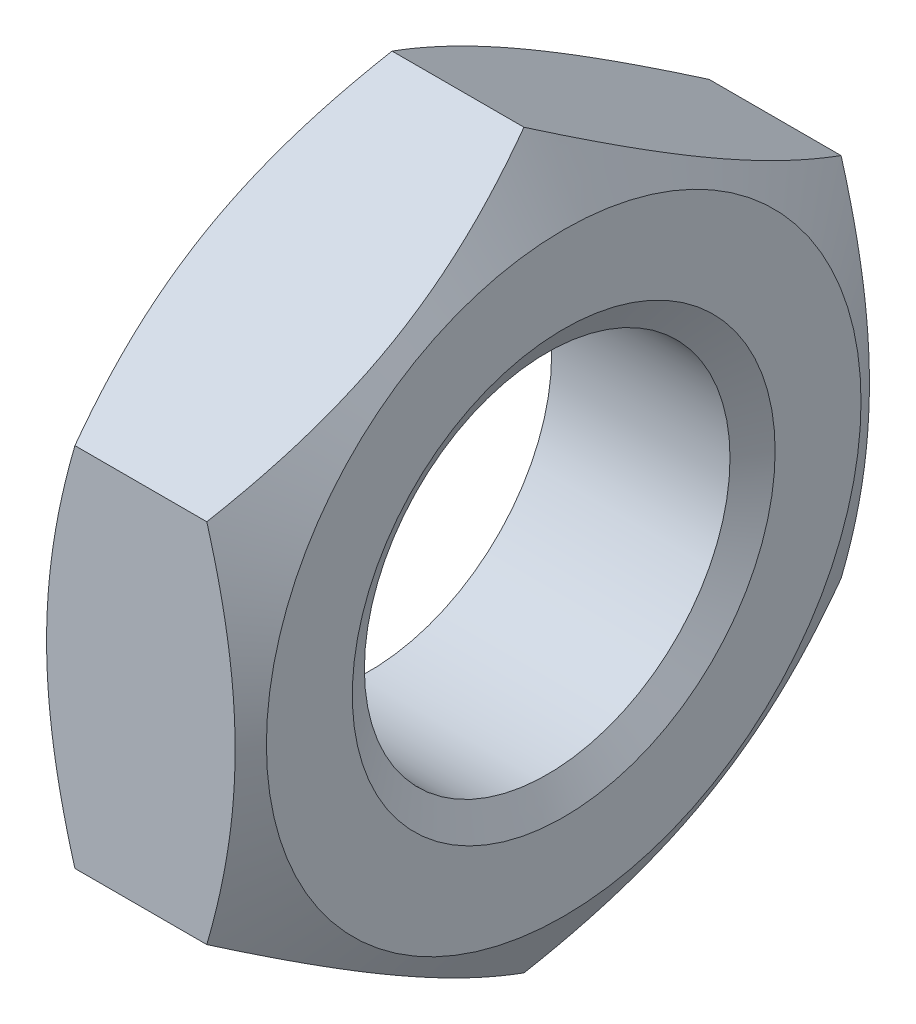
ISO-10303-21;
HEADER;
FILE_DESCRIPTION(('STEP AP214'),'2;1');
FILE_NAME('part.step','',(''),(''),'','','');
FILE_SCHEMA(('AUTOMOTIVE_DESIGN { 1 0 10303 214 1 1 1 1 }'));
ENDSEC;
DATA;
#1=APPLICATION_CONTEXT('core data for automotive mechanical design processes');
#2=APPLICATION_PROTOCOL_DEFINITION('international standard','automotive_design',2000,#1);
#3=PRODUCT_CONTEXT('',#1,'mechanical');
#4=PRODUCT('Part','Part','',(#3));
#5=PRODUCT_RELATED_PRODUCT_CATEGORY('part','',(#4));
#6=PRODUCT_DEFINITION_FORMATION('','',#4);
#7=PRODUCT_DEFINITION_CONTEXT('part definition',#1,'design');
#8=PRODUCT_DEFINITION('design','',#6,#7);
#9=PRODUCT_DEFINITION_SHAPE('','',#8);
#10=(LENGTH_UNIT() NAMED_UNIT(*) SI_UNIT(.MILLI.,.METRE.));
#11=(NAMED_UNIT(*) PLANE_ANGLE_UNIT() SI_UNIT($,.RADIAN.));
#12=(NAMED_UNIT(*) SI_UNIT($,.STERADIAN.) SOLID_ANGLE_UNIT());
#13=UNCERTAINTY_MEASURE_WITH_UNIT(LENGTH_MEASURE(1.E-05),#10,'distance_accuracy_value','');
#14=(GEOMETRIC_REPRESENTATION_CONTEXT(3) GLOBAL_UNCERTAINTY_ASSIGNED_CONTEXT((#13)) GLOBAL_UNIT_ASSIGNED_CONTEXT((#10,
#11,#12)) REPRESENTATION_CONTEXT('',''));
#15=CARTESIAN_POINT('',(0.,0.,0.));
#16=DIRECTION('',(0.,0.,1.));
#17=DIRECTION('',(1.,0.,0.));
#18=AXIS2_PLACEMENT_3D('',#15,#16,#17);
#19=CARTESIAN_POINT('',(8.,0.,0.));
#20=DIRECTION('',(1.,0.,0.));
#21=DIRECTION('',(0.,0.,-1.));
#22=AXIS2_PLACEMENT_3D('',#19,#20,#21);
#23=PLANE('',#22);
#24=CARTESIAN_POINT('',(8.,0.,0.));
#25=DIRECTION('',(1.,0.,0.));
#26=DIRECTION('',(0.,0.,-1.));
#27=AXIS2_PLACEMENT_3D('',#24,#25,#26);
#28=CIRCLE('',#27,8.00003175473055);
#29=CARTESIAN_POINT('',(8.,0.,-8.00003175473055));
#30=VERTEX_POINT('',#29);
#31=EDGE_CURVE('E83',#30,#30,#28,.T.);
#32=ORIENTED_EDGE('',*,*,#31,.F.);
#33=EDGE_LOOP('',(#32));
#34=FACE_BOUND('',#33,.T.);
#35=CARTESIAN_POINT('',(8.,0.,0.));
#36=DIRECTION('',(-1.,0.,0.));
#37=DIRECTION('',(0.,0.,1.));
#38=AXIS2_PLACEMENT_3D('',#35,#36,#37);
#39=CIRCLE('',#38,11.25);
#40=CARTESIAN_POINT('',(8.,0.,11.25));
#41=VERTEX_POINT('',#40);
#42=EDGE_CURVE('E21',#41,#41,#39,.F.);
#43=ORIENTED_EDGE('',*,*,#42,.T.);
#44=EDGE_LOOP('',(#43));
#45=FACE_BOUND('',#44,.T.);
#46=ADVANCED_FACE('F17',(#34,#45),#23,.T.);
#47=CARTESIAN_POINT('',(8.,0.,0.));
#48=DIRECTION('',(-1.,0.,0.));
#49=DIRECTION('',(0.,0.,1.));
#50=AXIS2_PLACEMENT_3D('',#47,#48,#49);
#51=CONICAL_SURFACE('',#50,11.25,1.0471975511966);
#52=ORIENTED_EDGE('',*,*,#42,.F.);
#53=EDGE_LOOP('',(#52));
#54=FACE_BOUND('',#53,.T.);
#55=CARTESIAN_POINT('',(6.49519052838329,-13.856406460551,0.));
#56=CARTESIAN_POINT('',(6.58310157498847,-13.7041106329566,0.263784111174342));
#57=CARTESIAN_POINT('',(6.66702238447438,-13.5512469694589,0.52855174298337));
#58=CARTESIAN_POINT('',(6.82577639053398,-13.2442938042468,1.06021022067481));
#59=CARTESIAN_POINT('',(6.90060659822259,-13.0902039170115,1.32710173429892));
#60=CARTESIAN_POINT('',(7.11001307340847,-12.6254515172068,2.1320765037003));
#61=CARTESIAN_POINT('',(7.22912111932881,-12.3129543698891,2.6733374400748));
#62=CARTESIAN_POINT('',(7.36878397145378,-11.8453167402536,3.48330957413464));
#63=CARTESIAN_POINT('',(7.40856818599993,-11.6915732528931,3.74960110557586));
#64=CARTESIAN_POINT('',(7.47528254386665,-11.3833744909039,4.28341702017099));
#65=CARTESIAN_POINT('',(7.50221243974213,-11.2289192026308,4.55094142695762));
#66=CARTESIAN_POINT('',(7.54252836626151,-10.9197511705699,5.08643616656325));
#67=CARTESIAN_POINT('',(7.55593049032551,-10.7650389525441,5.35440558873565));
#68=CARTESIAN_POINT('',(7.56890529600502,-10.4554712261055,5.89059261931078));
#69=CARTESIAN_POINT('',(7.56847840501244,-10.300615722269,6.15881021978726));
#70=CARTESIAN_POINT('',(7.55476109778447,-10.0111206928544,6.66023031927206));
#71=CARTESIAN_POINT('',(7.54314389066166,-9.87646050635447,6.89346860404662));
#72=CARTESIAN_POINT('',(7.50967072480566,-9.6074498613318,7.35940870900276));
#73=CARTESIAN_POINT('',(7.48781404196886,-9.47309942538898,7.59211049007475));
#74=CARTESIAN_POINT('',(7.4342429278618,-9.20478128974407,8.05685113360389));
#75=CARTESIAN_POINT('',(7.40252035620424,-9.07081399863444,8.28888928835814));
#76=CARTESIAN_POINT('',(7.32977398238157,-8.80350745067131,8.75187781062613));
#77=CARTESIAN_POINT('',(7.28874954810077,-8.67016823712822,8.98282810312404));
#78=CARTESIAN_POINT('',(7.1506864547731,-8.26541000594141,9.68388992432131));
#79=CARTESIAN_POINT('',(7.03988213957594,-7.99516303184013,10.1519714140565));
#80=CARTESIAN_POINT('',(6.78840249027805,-7.45869851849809,11.0811552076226));
#81=CARTESIAN_POINT('',(6.64778620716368,-7.19247411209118,11.5422694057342));
#82=CARTESIAN_POINT('',(6.49519052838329,-6.92820323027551,12.));
#83=B_SPLINE_CURVE_WITH_KNOTS('',3,(#55,#56,#57,#58,#59,#60,#61,#62,#63,#64,#65,#66,#67,#68,#69,
#70,#71,#72,#73,#74,#75,#76,#77,#78,#79,#80,#81,#82),.UNSPECIFIED.,.F.,.F.,(4,2,2,2,2,2,2,2,2,2,
2,2,2,4),(0.,0.950996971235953,1.9023057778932,3.80897261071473,4.73890631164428,
5.66885791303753,6.59770188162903,7.52651714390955,8.33503482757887,9.1436096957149,
9.95285350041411,10.7621523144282,12.4163368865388,14.0672749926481),.UNSPECIFIED.);
#84=CARTESIAN_POINT('',(6.49519052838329,-13.856406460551,0.));
#85=VERTEX_POINT('',#84);
#86=CARTESIAN_POINT('',(6.49519052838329,-6.92820323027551,12.));
#87=VERTEX_POINT('',#86);
#88=EDGE_CURVE('E86',#85,#87,#83,.T.);
#89=ORIENTED_EDGE('',*,*,#88,.F.);
#90=CARTESIAN_POINT('',(6.49519052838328,-6.92820323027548,-12.));
#91=CARTESIAN_POINT('',(6.58310157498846,-7.08049905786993,-11.7362158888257));
#92=CARTESIAN_POINT('',(6.66702238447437,-7.23336272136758,-11.4714482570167));
#93=CARTESIAN_POINT('',(6.82577639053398,-7.54031588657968,-10.9397897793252));
#94=CARTESIAN_POINT('',(6.90060659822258,-7.69440577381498,-10.6728982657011));
#95=CARTESIAN_POINT('',(7.11001307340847,-8.15915817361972,-9.86792349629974));
#96=CARTESIAN_POINT('',(7.22912111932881,-8.47165532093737,-9.32666255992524));
#97=CARTESIAN_POINT('',(7.36878397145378,-8.93929295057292,-8.51669042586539));
#98=CARTESIAN_POINT('',(7.40856818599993,-9.09303643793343,-8.25039889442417));
#99=CARTESIAN_POINT('',(7.47528254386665,-9.40123519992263,-7.71658297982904));
#100=CARTESIAN_POINT('',(7.50221243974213,-9.55569048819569,-7.44905857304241));
#101=CARTESIAN_POINT('',(7.54252836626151,-9.86485852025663,-6.91356383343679));
#102=CARTESIAN_POINT('',(7.55593049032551,-10.0195707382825,-6.64559441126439));
#103=CARTESIAN_POINT('',(7.56890529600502,-10.329138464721,-6.10940738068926));
#104=CARTESIAN_POINT('',(7.56847840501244,-10.4839939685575,-5.84118978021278));
#105=CARTESIAN_POINT('',(7.55476109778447,-10.7734889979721,-5.33976968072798));
#106=CARTESIAN_POINT('',(7.54314389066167,-10.908149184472,-5.10653139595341));
#107=CARTESIAN_POINT('',(7.50967072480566,-11.1771598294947,-4.64059129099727));
#108=CARTESIAN_POINT('',(7.48781404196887,-11.3115102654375,-4.40788950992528));
#109=CARTESIAN_POINT('',(7.43424292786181,-11.5798284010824,-3.94314886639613));
#110=CARTESIAN_POINT('',(7.40252035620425,-11.7137956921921,-3.71111071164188));
#111=CARTESIAN_POINT('',(7.32977398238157,-11.9811022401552,-3.24812218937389));
#112=CARTESIAN_POINT('',(7.28874954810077,-12.1144414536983,-3.01717189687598));
#113=CARTESIAN_POINT('',(7.15068645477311,-12.5191996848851,-2.31611007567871));
#114=CARTESIAN_POINT('',(7.03988213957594,-12.7894466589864,-1.84802858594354));
#115=CARTESIAN_POINT('',(6.78840249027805,-13.3259111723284,-0.918844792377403));
#116=CARTESIAN_POINT('',(6.64778620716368,-13.5921355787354,-0.457730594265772));
#117=CARTESIAN_POINT('',(6.49519052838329,-13.856406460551,0.));
#118=B_SPLINE_CURVE_WITH_KNOTS('',3,(#90,#91,#92,#93,#94,#95,#96,#97,#98,#99,#100,#101,#102,
#103,#104,#105,#106,#107,#108,#109,#110,#111,#112,#113,#114,#115,#116,#117),.UNSPECIFIED.,.F.,
.F.,(4,2,2,2,2,2,2,2,2,2,2,2,2,4),(0.,0.950996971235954,1.9023057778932,3.80897261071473,
4.73890631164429,5.66885791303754,6.59770188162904,7.52651714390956,8.33503482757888,
9.14360969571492,9.95285350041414,10.7621523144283,12.4163368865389,14.0672749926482),.UNSPECIFIED.);
#119=CARTESIAN_POINT('',(6.49519052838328,-6.92820323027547,-12.));
#120=VERTEX_POINT('',#119);
#121=EDGE_CURVE('E91',#120,#85,#118,.T.);
#122=ORIENTED_EDGE('',*,*,#121,.F.);
#123=CARTESIAN_POINT('',(6.49519052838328,6.92820323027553,-12.));
#124=CARTESIAN_POINT('',(6.58310157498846,6.62361157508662,-12.));
#125=CARTESIAN_POINT('',(6.66702238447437,6.31788424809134,-12.));
#126=CARTESIAN_POINT('',(6.82577639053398,5.70397791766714,-12.));
#127=CARTESIAN_POINT('',(6.90060659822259,5.39579814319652,-12.));
#128=CARTESIAN_POINT('',(7.11001307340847,4.46629334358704,-12.));
#129=CARTESIAN_POINT('',(7.22912111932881,3.84129904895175,-12.));
#130=CARTESIAN_POINT('',(7.36878397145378,2.90602378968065,-12.));
#131=CARTESIAN_POINT('',(7.40856818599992,2.59853681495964,-12.));
#132=CARTESIAN_POINT('',(7.47528254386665,1.98213929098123,-12.));
#133=CARTESIAN_POINT('',(7.50221243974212,1.67322871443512,-12.));
#134=CARTESIAN_POINT('',(7.5425283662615,1.05489265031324,-12.));
#135=CARTESIAN_POINT('',(7.5559304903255,0.745468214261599,-12.));
#136=CARTESIAN_POINT('',(7.56890529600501,0.126332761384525,-12.));
#137=CARTESIAN_POINT('',(7.56847840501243,-0.18337824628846,-12.));
#138=CARTESIAN_POINT('',(7.55476109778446,-0.762368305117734,-12.));
#139=CARTESIAN_POINT('',(7.54314389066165,-1.03168867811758,-12.));
#140=CARTESIAN_POINT('',(7.50967072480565,-1.56970996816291,-12.));
#141=CARTESIAN_POINT('',(7.48781404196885,-1.83841084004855,-12.));
#142=CARTESIAN_POINT('',(7.43424292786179,-2.37504711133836,-12.));
#143=CARTESIAN_POINT('',(7.40252035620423,-2.64298169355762,-12.));
#144=CARTESIAN_POINT('',(7.32977398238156,-3.17759478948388,-12.));
#145=CARTESIAN_POINT('',(7.28874954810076,-3.44427321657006,-12.));
#146=CARTESIAN_POINT('',(7.15068645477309,-4.25378967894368,-12.));
#147=CARTESIAN_POINT('',(7.03988213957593,-4.79428362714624,-12.));
#148=CARTESIAN_POINT('',(6.78840249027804,-5.86721265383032,-12.));
#149=CARTESIAN_POINT('',(6.64778620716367,-6.39966146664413,-12.));
#150=CARTESIAN_POINT('',(6.49519052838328,-6.92820323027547,-12.));
#151=B_SPLINE_CURVE_WITH_KNOTS('',3,(#123,#124,#125,#126,#127,#128,#129,#130,#131,#132,#133,
#134,#135,#136,#137,#138,#139,#140,#141,#142,#143,#144,#145,#146,#147,#148,#149,#150),
.UNSPECIFIED.,.F.,.F.,(4,2,2,2,2,2,2,2,2,2,2,2,2,4),(0.,0.950996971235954,1.9023057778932,
3.80897261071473,4.73890631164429,5.66885791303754,6.59770188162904,7.52651714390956,
8.33503482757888,9.1436096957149,9.95285350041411,10.7621523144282,12.4163368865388,
14.0672749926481),.UNSPECIFIED.);
#152=CARTESIAN_POINT('',(6.49519052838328,6.92820323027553,-12.));
#153=VERTEX_POINT('',#152);
#154=EDGE_CURVE('E95',#153,#120,#151,.T.);
#155=ORIENTED_EDGE('',*,*,#154,.F.);
#156=CARTESIAN_POINT('',(6.49519052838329,13.856406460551,0.));
#157=CARTESIAN_POINT('',(6.58310157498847,13.7041106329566,-0.263784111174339));
#158=CARTESIAN_POINT('',(6.66702238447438,13.5512469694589,-0.528551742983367));
#159=CARTESIAN_POINT('',(6.82577639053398,13.2442938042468,-1.06021022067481));
#160=CARTESIAN_POINT('',(6.90060659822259,13.0902039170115,-1.32710173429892));
#161=CARTESIAN_POINT('',(7.11001307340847,12.6254515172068,-2.1320765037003));
#162=CARTESIAN_POINT('',(7.22912111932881,12.3129543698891,-2.6733374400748));
#163=CARTESIAN_POINT('',(7.36878397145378,11.8453167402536,-3.48330957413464));
#164=CARTESIAN_POINT('',(7.40856818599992,11.6915732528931,-3.74960110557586));
#165=CARTESIAN_POINT('',(7.47528254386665,11.3833744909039,-4.28341702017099));
#166=CARTESIAN_POINT('',(7.50221243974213,11.2289192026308,-4.55094142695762));
#167=CARTESIAN_POINT('',(7.54252836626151,10.9197511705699,-5.08643616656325));
#168=CARTESIAN_POINT('',(7.5559304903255,10.7650389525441,-5.35440558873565));
#169=CARTESIAN_POINT('',(7.56890529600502,10.4554712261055,-5.89059261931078));
#170=CARTESIAN_POINT('',(7.56847840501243,10.300615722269,-6.15881021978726));
#171=CARTESIAN_POINT('',(7.55476109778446,10.0111206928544,-6.66023031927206));
#172=CARTESIAN_POINT('',(7.54314389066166,9.87646050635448,-6.89346860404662));
#173=CARTESIAN_POINT('',(7.50967072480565,9.60744986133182,-7.35940870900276));
#174=CARTESIAN_POINT('',(7.48781404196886,9.473099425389,-7.59211049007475));
#175=CARTESIAN_POINT('',(7.43424292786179,9.20478128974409,-8.05685113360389));
#176=CARTESIAN_POINT('',(7.40252035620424,9.07081399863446,-8.28888928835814));
#177=CARTESIAN_POINT('',(7.32977398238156,8.80350745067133,-8.75187781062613));
#178=CARTESIAN_POINT('',(7.28874954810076,8.67016823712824,-8.98282810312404));
#179=CARTESIAN_POINT('',(7.1506864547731,8.26541000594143,-9.68388992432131));
#180=CARTESIAN_POINT('',(7.03988213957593,7.99516303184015,-10.1519714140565));
#181=CARTESIAN_POINT('',(6.78840249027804,7.45869851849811,-11.0811552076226));
#182=CARTESIAN_POINT('',(6.64778620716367,7.19247411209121,-11.5422694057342));
#183=CARTESIAN_POINT('',(6.49519052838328,6.92820323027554,-12.));
#184=B_SPLINE_CURVE_WITH_KNOTS('',3,(#156,#157,#158,#159,#160,#161,#162,#163,#164,#165,#166,
#167,#168,#169,#170,#171,#172,#173,#174,#175,#176,#177,#178,#179,#180,#181,#182,#183),
.UNSPECIFIED.,.F.,.F.,(4,2,2,2,2,2,2,2,2,2,2,2,2,4),(0.,0.950996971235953,1.9023057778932,
3.80897261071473,4.73890631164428,5.66885791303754,6.59770188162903,7.52651714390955,
8.33503482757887,9.1436096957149,9.95285350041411,10.7621523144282,12.4163368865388,
14.0672749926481),.UNSPECIFIED.);
#185=CARTESIAN_POINT('',(6.49519052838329,13.856406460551,0.));
#186=VERTEX_POINT('',#185);
#187=EDGE_CURVE('E80',#186,#153,#184,.T.);
#188=ORIENTED_EDGE('',*,*,#187,.F.);
#189=CARTESIAN_POINT('',(6.49519052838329,6.9282032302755,12.));
#190=CARTESIAN_POINT('',(6.58310157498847,7.08049905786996,11.7362158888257));
#191=CARTESIAN_POINT('',(6.66702238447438,7.2333627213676,11.4714482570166));
#192=CARTESIAN_POINT('',(6.82577639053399,7.5403158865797,10.9397897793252));
#193=CARTESIAN_POINT('',(6.90060659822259,7.69440577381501,10.6728982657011));
#194=CARTESIAN_POINT('',(7.11001307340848,8.15915817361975,9.8679234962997));
#195=CARTESIAN_POINT('',(7.22912111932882,8.47165532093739,9.3266625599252));
#196=CARTESIAN_POINT('',(7.36878397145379,8.93929295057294,8.51669042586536));
#197=CARTESIAN_POINT('',(7.40856818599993,9.09303643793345,8.25039889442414));
#198=CARTESIAN_POINT('',(7.47528254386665,9.40123519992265,7.71658297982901));
#199=CARTESIAN_POINT('',(7.50221243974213,9.55569048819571,7.44905857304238));
#200=CARTESIAN_POINT('',(7.54252836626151,9.86485852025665,6.91356383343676));
#201=CARTESIAN_POINT('',(7.55593049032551,10.0195707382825,6.64559441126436));
#202=CARTESIAN_POINT('',(7.56890529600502,10.329138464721,6.10940738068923));
#203=CARTESIAN_POINT('',(7.56847840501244,10.4839939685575,5.84118978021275));
#204=CARTESIAN_POINT('',(7.55476109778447,10.7734889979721,5.33976968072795));
#205=CARTESIAN_POINT('',(7.54314389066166,10.9081491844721,5.10653139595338));
#206=CARTESIAN_POINT('',(7.50967072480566,11.1771598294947,4.64059129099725));
#207=CARTESIAN_POINT('',(7.48781404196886,11.3115102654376,4.40788950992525));
#208=CARTESIAN_POINT('',(7.4342429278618,11.5798284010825,3.94314886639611));
#209=CARTESIAN_POINT('',(7.40252035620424,11.7137956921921,3.71111071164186));
#210=CARTESIAN_POINT('',(7.32977398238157,11.9811022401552,3.24812218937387));
#211=CARTESIAN_POINT('',(7.28874954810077,12.1144414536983,3.01717189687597));
#212=CARTESIAN_POINT('',(7.1506864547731,12.5191996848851,2.3161100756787));
#213=CARTESIAN_POINT('',(7.03988213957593,12.7894466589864,1.84802858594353));
#214=CARTESIAN_POINT('',(6.78840249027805,13.3259111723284,0.918844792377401));
#215=CARTESIAN_POINT('',(6.64778620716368,13.5921355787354,0.457730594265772));
#216=CARTESIAN_POINT('',(6.49519052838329,13.856406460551,0.));
#217=B_SPLINE_CURVE_WITH_KNOTS('',3,(#189,#190,#191,#192,#193,#194,#195,#196,#197,#198,#199,
#200,#201,#202,#203,#204,#205,#206,#207,#208,#209,#210,#211,#212,#213,#214,#215,#216),
.UNSPECIFIED.,.F.,.F.,(4,2,2,2,2,2,2,2,2,2,2,2,2,4),(0.,0.950996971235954,1.9023057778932,
3.80897261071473,4.73890631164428,5.66885791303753,6.59770188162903,7.52651714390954,
8.33503482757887,9.1436096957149,9.95285350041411,10.7621523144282,12.4163368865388,
14.0672749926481),.UNSPECIFIED.);
#218=CARTESIAN_POINT('',(6.49519052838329,6.92820323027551,12.));
#219=VERTEX_POINT('',#218);
#220=EDGE_CURVE('E74',#219,#186,#217,.T.);
#221=ORIENTED_EDGE('',*,*,#220,.F.);
#222=CARTESIAN_POINT('',(6.49519052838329,-6.92820323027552,12.));
#223=CARTESIAN_POINT('',(6.58310157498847,-6.62361157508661,12.));
#224=CARTESIAN_POINT('',(6.66702238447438,-6.31788424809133,12.));
#225=CARTESIAN_POINT('',(6.82577639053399,-5.70397791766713,12.));
#226=CARTESIAN_POINT('',(6.90060659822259,-5.39579814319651,12.));
#227=CARTESIAN_POINT('',(7.11001307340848,-4.46629334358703,12.));
#228=CARTESIAN_POINT('',(7.22912111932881,-3.84129904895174,12.));
#229=CARTESIAN_POINT('',(7.36878397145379,-2.90602378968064,12.));
#230=CARTESIAN_POINT('',(7.40856818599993,-2.59853681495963,12.));
#231=CARTESIAN_POINT('',(7.47528254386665,-1.98213929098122,12.));
#232=CARTESIAN_POINT('',(7.50221243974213,-1.67322871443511,12.));
#233=CARTESIAN_POINT('',(7.54252836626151,-1.05489265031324,12.));
#234=CARTESIAN_POINT('',(7.55593049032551,-0.745468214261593,12.));
#235=CARTESIAN_POINT('',(7.56890529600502,-0.126332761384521,12.));
#236=CARTESIAN_POINT('',(7.56847840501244,0.183378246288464,12.));
#237=CARTESIAN_POINT('',(7.55476109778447,0.762368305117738,12.));
#238=CARTESIAN_POINT('',(7.54314389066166,1.03168867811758,12.));
#239=CARTESIAN_POINT('',(7.50967072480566,1.56970996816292,12.));
#240=CARTESIAN_POINT('',(7.48781404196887,1.83841084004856,12.));
#241=CARTESIAN_POINT('',(7.43424292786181,2.37504711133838,12.));
#242=CARTESIAN_POINT('',(7.40252035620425,2.64298169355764,12.));
#243=CARTESIAN_POINT('',(7.32977398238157,3.1775947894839,12.));
#244=CARTESIAN_POINT('',(7.28874954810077,3.44427321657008,12.));
#245=CARTESIAN_POINT('',(7.15068645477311,4.25378967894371,12.));
#246=CARTESIAN_POINT('',(7.03988213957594,4.79428362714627,12.));
#247=CARTESIAN_POINT('',(6.78840249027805,5.86721265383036,12.));
#248=CARTESIAN_POINT('',(6.64778620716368,6.39966146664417,12.));
#249=CARTESIAN_POINT('',(6.49519052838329,6.92820323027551,12.));
#250=B_SPLINE_CURVE_WITH_KNOTS('',3,(#222,#223,#224,#225,#226,#227,#228,#229,#230,#231,#232,
#233,#234,#235,#236,#237,#238,#239,#240,#241,#242,#243,#244,#245,#246,#247,#248,#249),
.UNSPECIFIED.,.F.,.F.,(4,2,2,2,2,2,2,2,2,2,2,2,2,4),(0.,0.950996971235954,1.9023057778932,
3.80897261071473,4.73890631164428,5.66885791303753,6.59770188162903,7.52651714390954,
8.33503482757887,9.1436096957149,9.95285350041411,10.7621523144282,12.4163368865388,
14.0672749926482),.UNSPECIFIED.);
#251=EDGE_CURVE('E64',#87,#219,#250,.T.);
#252=ORIENTED_EDGE('',*,*,#251,.F.);
#253=EDGE_LOOP('',(#89,#122,#155,#188,#221,#252));
#254=FACE_BOUND('',#253,.T.);
#255=ADVANCED_FACE('F78',(#54,#254),#51,.T.);
#256=CARTESIAN_POINT('',(7.375,0.,0.));
#257=DIRECTION('',(1.,0.,0.));
#258=DIRECTION('',(0.,0.,-1.));
#259=AXIS2_PLACEMENT_3D('',#256,#257,#258);
#260=CONICAL_SURFACE('',#259,6.9175,1.0471975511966);
#261=CARTESIAN_POINT('',(7.375,0.,0.));
#262=DIRECTION('',(1.,0.,0.));
#263=DIRECTION('',(0.,0.,-1.));
#264=AXIS2_PLACEMENT_3D('',#261,#262,#263);
#265=CIRCLE('',#264,6.9175);
#266=CARTESIAN_POINT('',(7.375,0.,-6.9175));
#267=VERTEX_POINT('',#266);
#268=EDGE_CURVE('E102',#267,#267,#265,.F.);
#269=ORIENTED_EDGE('',*,*,#268,.T.);
#270=EDGE_LOOP('',(#269));
#271=FACE_BOUND('',#270,.T.);
#272=ORIENTED_EDGE('',*,*,#31,.T.);
#273=EDGE_LOOP('',(#272));
#274=FACE_BOUND('',#273,.T.);
#275=ADVANCED_FACE('F157',(#271,#274),#260,.F.);
#276=CARTESIAN_POINT('',(0.,6.92820323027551,12.));
#277=DIRECTION('',(0.,0.866025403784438,0.500000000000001));
#278=DIRECTION('',(0.,-0.500000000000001,0.866025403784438));
#279=AXIS2_PLACEMENT_3D('',#276,#277,#278);
#280=PLANE('',#279);
#281=ORIENTED_EDGE('',*,*,#220,.T.);
#282=DIRECTION('',(1.,0.,0.));
#283=VECTOR('',#282,1.);
#284=CARTESIAN_POINT('',(0.,13.856406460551,0.));
#285=LINE('',#284,#283);
#286=CARTESIAN_POINT('',(1.50480947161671,13.856406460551,0.));
#287=VERTEX_POINT('',#286);
#288=EDGE_CURVE('E99',#287,#186,#285,.T.);
#289=ORIENTED_EDGE('',*,*,#288,.F.);
#290=CARTESIAN_POINT('',(1.50480947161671,13.856406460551,0.));
#291=CARTESIAN_POINT('',(1.41689842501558,13.7041106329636,0.263784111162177));
#292=CARTESIAN_POINT('',(1.33297761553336,13.551246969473,0.528551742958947));
#293=CARTESIAN_POINT('',(1.17422360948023,13.2442938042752,1.0602102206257));
#294=CARTESIAN_POINT('',(1.09939340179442,13.090203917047,1.32710173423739));
#295=CARTESIAN_POINT('',(0.889986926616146,12.6254515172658,2.132076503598));
#296=CARTESIAN_POINT('',(0.770878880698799,12.3129543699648,2.67333743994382));
#297=CARTESIAN_POINT('',(0.631216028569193,11.8453167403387,3.48330957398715));
#298=CARTESIAN_POINT('',(0.591431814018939,11.691573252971,3.74960110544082));
#299=CARTESIAN_POINT('',(0.524717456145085,11.3833744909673,4.2834170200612));
#300=CARTESIAN_POINT('',(0.497787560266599,11.2289192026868,4.55094142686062));
#301=CARTESIAN_POINT('',(0.457471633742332,10.9197511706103,5.08643616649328));
#302=CARTESIAN_POINT('',(0.444069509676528,10.7650389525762,5.35440558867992));
#303=CARTESIAN_POINT('',(0.431094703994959,10.4554712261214,5.89059261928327));
#304=CARTESIAN_POINT('',(0.431521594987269,10.3006157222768,6.15881021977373));
#305=CARTESIAN_POINT('',(0.445238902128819,10.011120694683,6.66023031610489));
#306=CARTESIAN_POINT('',(0.456856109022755,9.87646051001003,6.89346859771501));
#307=CARTESIAN_POINT('',(0.490329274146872,9.60744986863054,7.35940869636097));
#308=CARTESIAN_POINT('',(0.512185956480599,9.4730994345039,7.59211047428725));
#309=CARTESIAN_POINT('',(0.565757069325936,9.20478130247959,8.05685111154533));
#310=CARTESIAN_POINT('',(0.597479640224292,9.07081401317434,8.28888926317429));
#311=CARTESIAN_POINT('',(0.670226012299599,8.80350746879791,8.75187777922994));
#312=CARTESIAN_POINT('',(0.711250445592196,8.67016825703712,8.9828280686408));
#313=CARTESIAN_POINT('',(0.849313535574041,8.26541003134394,9.68388988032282));
#314=CARTESIAN_POINT('',(0.960117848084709,7.99516306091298,10.1519713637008));
#315=CARTESIAN_POINT('',(1.21159749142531,7.45869855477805,11.0811551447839));
#316=CARTESIAN_POINT('',(1.35221377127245,7.19247415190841,11.5422693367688));
#317=CARTESIAN_POINT('',(1.50480944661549,6.92820327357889,11.9999999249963));
#318=B_SPLINE_CURVE_WITH_KNOTS('',3,(#290,#291,#292,#293,#294,#295,#296,#297,#298,#299,#300,
#301,#302,#303,#304,#305,#306,#307,#308,#309,#310,#311,#312,#313,#314,#315,#316,#317),
.UNSPECIFIED.,.F.,.F.,(4,2,2,2,2,2,2,2,2,2,2,2,2,4),(0.,0.950996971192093,1.90230577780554,
3.80897261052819,4.73890631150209,5.6688579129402,6.59770188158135,7.52651714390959,
8.33503481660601,9.14360967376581,9.95285346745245,10.7621522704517,12.4163368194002,
14.0672749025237),.UNSPECIFIED.);
#319=CARTESIAN_POINT('',(1.50480947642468,6.92820324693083,12.));
#320=VERTEX_POINT('',#319);
#321=EDGE_CURVE('E36',#287,#320,#318,.T.);
#322=ORIENTED_EDGE('',*,*,#321,.T.);
#323=DIRECTION('',(1.,0.,0.));
#324=VECTOR('',#323,1.);
#325=CARTESIAN_POINT('',(0.,6.92820323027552,12.));
#326=LINE('',#325,#324);
#327=EDGE_CURVE('E69',#219,#320,#326,.F.);
#328=ORIENTED_EDGE('',*,*,#327,.F.);
#329=EDGE_LOOP('',(#281,#289,#322,#328));
#330=FACE_BOUND('',#329,.T.);
#331=ADVANCED_FACE('F85',(#330),#280,.T.);
#332=CARTESIAN_POINT('',(0.,-6.92820323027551,12.));
#333=DIRECTION('',(0.,0.,1.));
#334=DIRECTION('',(1.,0.,0.));
#335=AXIS2_PLACEMENT_3D('',#332,#333,#334);
#336=PLANE('',#335);
#337=ORIENTED_EDGE('',*,*,#251,.T.);
#338=ORIENTED_EDGE('',*,*,#327,.T.);
#339=CARTESIAN_POINT('',(1.50480948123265,6.92820326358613,12.));
#340=CARTESIAN_POINT('',(1.41689843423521,6.6236116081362,12.));
#341=CARTESIAN_POINT('',(1.33297762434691,6.31788428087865,12.));
#342=CARTESIAN_POINT('',(1.17422361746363,5.7039779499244,12.));
#343=CARTESIAN_POINT('',(1.09939340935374,5.395798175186,12.));
#344=CARTESIAN_POINT('',(0.889986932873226,4.46629337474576,12.));
#345=CARTESIAN_POINT('',(0.770878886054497,3.84129907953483,12.));
#346=CARTESIAN_POINT('',(0.631216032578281,2.90602381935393,12.));
#347=CARTESIAN_POINT('',(0.5914318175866,2.59853684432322,12.));
#348=CARTESIAN_POINT('',(0.524717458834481,1.98213931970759,12.));
#349=CARTESIAN_POINT('',(0.497787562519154,1.67322874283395,12.));
#350=CARTESIAN_POINT('',(0.457471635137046,1.0548926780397,12.));
#351=CARTESIAN_POINT('',(0.444069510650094,0.745468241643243,12.));
#352=CARTESIAN_POINT('',(0.43109470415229,0.126332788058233,12.));
#353=CARTESIAN_POINT('',(0.431521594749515,-0.183378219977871,12.));
#354=CARTESIAN_POINT('',(0.445238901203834,-0.762368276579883,12.));
#355=CARTESIAN_POINT('',(0.456856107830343,-1.03168864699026,12.));
#356=CARTESIAN_POINT('',(0.490329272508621,-1.569709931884,12.));
#357=CARTESIAN_POINT('',(0.512185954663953,-1.83841080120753,12.));
#358=CARTESIAN_POINT('',(0.565757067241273,-2.37504706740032,12.));
#359=CARTESIAN_POINT('',(0.597479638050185,-2.64298164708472,12.));
#360=CARTESIAN_POINT('',(0.670226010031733,-3.17759473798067,12.));
#361=CARTESIAN_POINT('',(0.711250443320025,-3.44427316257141,12.));
#362=CARTESIAN_POINT('',(0.849313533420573,-4.2537896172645,12.));
#363=CARTESIAN_POINT('',(0.96011784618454,-4.79428356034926,12.));
#364=CARTESIAN_POINT('',(1.21159749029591,-5.86721257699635,12.));
#365=CARTESIAN_POINT('',(1.35221377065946,-6.39966138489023,12.));
#366=CARTESIAN_POINT('',(1.50480944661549,-6.92820314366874,12.));
#367=B_SPLINE_CURVE_WITH_KNOTS('',3,(#339,#340,#341,#342,#343,#344,#345,#346,#347,#348,#349,
#350,#351,#352,#353,#354,#355,#356,#357,#358,#359,#360,#361,#362,#363,#364,#365,#366),
.UNSPECIFIED.,.F.,.F.,(4,2,2,2,2,2,2,2,2,2,2,2,2,4),(0.,0.950996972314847,1.9023057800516,
3.80897261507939,4.73890631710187,5.66885791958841,6.59770188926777,7.52651715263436,
8.33503482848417,9.14360968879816,9.95285348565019,10.7621522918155,12.4163368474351,
14.0672749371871),.UNSPECIFIED.);
#368=CARTESIAN_POINT('',(1.50480947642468,-6.92820322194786,12.0000000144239));
#369=VERTEX_POINT('',#368);
#370=EDGE_CURVE('E186',#320,#369,#367,.T.);
#371=ORIENTED_EDGE('',*,*,#370,.T.);
#372=DIRECTION('',(1.,0.,0.));
#373=VECTOR('',#372,1.);
#374=CARTESIAN_POINT('',(0.,-6.92820323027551,12.));
#375=LINE('',#374,#373);
#376=EDGE_CURVE('E71',#87,#369,#375,.F.);
#377=ORIENTED_EDGE('',*,*,#376,.F.);
#378=EDGE_LOOP('',(#337,#338,#371,#377));
#379=FACE_BOUND('',#378,.T.);
#380=ADVANCED_FACE('F66',(#379),#336,.T.);
#381=CARTESIAN_POINT('',(0.,-13.856406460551,0.));
#382=DIRECTION('',(0.,-0.866025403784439,0.5));
#383=DIRECTION('',(0.,-0.5,-0.866025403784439));
#384=AXIS2_PLACEMENT_3D('',#381,#382,#383);
#385=PLANE('',#384);
#386=ORIENTED_EDGE('',*,*,#88,.T.);
#387=ORIENTED_EDGE('',*,*,#376,.T.);
#388=CARTESIAN_POINT('',(1.50480948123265,-6.9282032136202,12.0000000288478));
#389=CARTESIAN_POINT('',(1.41689843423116,-7.0804990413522,11.7362159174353));
#390=CARTESIAN_POINT('',(1.33297762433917,-7.23336270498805,11.4714482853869));
#391=CARTESIAN_POINT('',(1.17422361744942,-7.54031587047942,10.9397898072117));
#392=CARTESIAN_POINT('',(1.09939340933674,-7.6944057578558,10.6728982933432));
#393=CARTESIAN_POINT('',(0.88998693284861,-8.15915815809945,9.86792352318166));
#394=CARTESIAN_POINT('',(0.770878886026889,-8.47165530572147,9.32666258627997));
#395=CARTESIAN_POINT('',(0.631216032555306,-8.93929293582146,8.51669045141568));
#396=CARTESIAN_POINT('',(0.591431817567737,-9.09303642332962,8.25039891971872));
#397=CARTESIAN_POINT('',(0.524717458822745,-9.40123518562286,7.71658300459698));
#398=CARTESIAN_POINT('',(0.497787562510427,-9.5556904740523,7.44905859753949));
#399=CARTESIAN_POINT('',(0.457471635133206,-9.86485850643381,6.91356385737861));
#400=CARTESIAN_POINT('',(0.444069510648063,-10.0195707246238,6.64559443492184));
#401=CARTESIAN_POINT('',(0.431094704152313,-10.3291384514,6.10940740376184));
#402=CARTESIAN_POINT('',(0.431521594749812,-10.48399395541,5.84118980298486));
#403=CARTESIAN_POINT('',(0.445238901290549,-10.7734889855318,5.3397697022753));
#404=CARTESIAN_POINT('',(0.456856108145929,-10.908149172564,5.10653141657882));
#405=CARTESIAN_POINT('',(0.490329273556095,-11.177159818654,4.64059130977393));
#406=CARTESIAN_POINT('',(0.512185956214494,-11.3115102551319,4.40788952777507));
#407=CARTESIAN_POINT('',(0.565757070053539,-11.5798283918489,3.94314888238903));
#408=CARTESIAN_POINT('',(0.597479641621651,-11.7137956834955,3.71111072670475));
#409=CARTESIAN_POINT('',(0.670226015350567,-11.9811022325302,3.24812220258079));
#410=CARTESIAN_POINT('',(0.711250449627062,-12.1144414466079,3.01717190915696));
#411=CARTESIAN_POINT('',(0.849313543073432,-12.5191996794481,2.31611008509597));
#412=CARTESIAN_POINT('',(0.960117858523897,-12.7894466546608,1.84802859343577));
#413=CARTESIAN_POINT('',(1.21159750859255,-13.3259111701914,0.918844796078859));
#414=CARTESIAN_POINT('',(1.35221379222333,-13.5921355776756,0.457730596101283));
#415=CARTESIAN_POINT('',(1.50480947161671,-13.856406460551,0.));
#416=B_SPLINE_CURVE_WITH_KNOTS('',3,(#388,#389,#390,#391,#392,#393,#394,#395,#396,#397,#398,
#399,#400,#401,#402,#403,#404,#405,#406,#407,#408,#409,#410,#411,#412,#413,#414,#415),
.UNSPECIFIED.,.F.,.F.,(4,2,2,2,2,2,2,2,2,2,2,2,2,4),(0.,0.950996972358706,1.90230578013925,
3.80897261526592,4.73890631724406,5.66885791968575,6.59770188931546,7.52651715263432,
8.33503483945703,9.14360971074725,9.95285351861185,10.7621523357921,12.4163369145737,
14.0672750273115),.UNSPECIFIED.);
#417=CARTESIAN_POINT('',(1.50480947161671,-13.856406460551,0.));
#418=VERTEX_POINT('',#417);
#419=EDGE_CURVE('E191',#369,#418,#416,.T.);
#420=ORIENTED_EDGE('',*,*,#419,.T.);
#421=DIRECTION('',(1.,0.,0.));
#422=VECTOR('',#421,1.);
#423=CARTESIAN_POINT('',(0.,-13.856406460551,0.));
#424=LINE('',#423,#422);
#425=EDGE_CURVE('E92',#85,#418,#424,.F.);
#426=ORIENTED_EDGE('',*,*,#425,.F.);
#427=EDGE_LOOP('',(#386,#387,#420,#426));
#428=FACE_BOUND('',#427,.T.);
#429=ADVANCED_FACE('F183',(#428),#385,.T.);
#430=CARTESIAN_POINT('',(0.,-6.92820323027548,-12.));
#431=DIRECTION('',(0.,-0.866025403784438,-0.500000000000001));
#432=DIRECTION('',(0.,0.500000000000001,-0.866025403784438));
#433=AXIS2_PLACEMENT_3D('',#430,#431,#432);
#434=PLANE('',#433);
#435=ORIENTED_EDGE('',*,*,#121,.T.);
#436=ORIENTED_EDGE('',*,*,#425,.T.);
#437=CARTESIAN_POINT('',(1.50480947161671,-13.856406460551,0.));
#438=CARTESIAN_POINT('',(1.41689842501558,-13.7041106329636,-0.263784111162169));
#439=CARTESIAN_POINT('',(1.33297761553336,-13.551246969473,-0.528551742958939));
#440=CARTESIAN_POINT('',(1.17422360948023,-13.2442938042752,-1.06021022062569));
#441=CARTESIAN_POINT('',(1.09939340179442,-13.0902039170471,-1.32710173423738));
#442=CARTESIAN_POINT('',(0.889986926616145,-12.6254515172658,-2.13207650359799));
#443=CARTESIAN_POINT('',(0.770878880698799,-12.3129543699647,-2.67333743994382));
#444=CARTESIAN_POINT('',(0.631216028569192,-11.8453167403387,-3.48330957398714));
#445=CARTESIAN_POINT('',(0.591431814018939,-11.691573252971,-3.74960110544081));
#446=CARTESIAN_POINT('',(0.524717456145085,-11.3833744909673,-4.28341702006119));
#447=CARTESIAN_POINT('',(0.497787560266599,-11.2289192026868,-4.55094142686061));
#448=CARTESIAN_POINT('',(0.457471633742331,-10.9197511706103,-5.08643616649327));
#449=CARTESIAN_POINT('',(0.444069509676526,-10.7650389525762,-5.35440558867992));
#450=CARTESIAN_POINT('',(0.431094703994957,-10.4554712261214,-5.89059261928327));
#451=CARTESIAN_POINT('',(0.431521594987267,-10.3006157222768,-6.15881021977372));
#452=CARTESIAN_POINT('',(0.445238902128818,-10.0111206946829,-6.66023031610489));
#453=CARTESIAN_POINT('',(0.456856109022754,-9.87646051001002,-6.89346859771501));
#454=CARTESIAN_POINT('',(0.49032927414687,-9.60744986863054,-7.35940869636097));
#455=CARTESIAN_POINT('',(0.512185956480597,-9.47309943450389,-7.59211047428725));
#456=CARTESIAN_POINT('',(0.565757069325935,-9.20478130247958,-8.05685111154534));
#457=CARTESIAN_POINT('',(0.597479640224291,-9.07081401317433,-8.2888892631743));
#458=CARTESIAN_POINT('',(0.6702260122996,-8.8035074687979,-8.75187777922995));
#459=CARTESIAN_POINT('',(0.711250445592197,-8.67016825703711,-8.98282806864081));
#460=CARTESIAN_POINT('',(0.849313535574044,-8.26541003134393,-9.68388988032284));
#461=CARTESIAN_POINT('',(0.960117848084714,-7.99516306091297,-10.1519713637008));
#462=CARTESIAN_POINT('',(1.21159749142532,-7.45869855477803,-11.0811551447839));
#463=CARTESIAN_POINT('',(1.35221377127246,-7.19247415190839,-11.5422693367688));
#464=CARTESIAN_POINT('',(1.5048094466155,-6.92820327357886,-11.9999999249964));
#465=B_SPLINE_CURVE_WITH_KNOTS('',3,(#437,#438,#439,#440,#441,#442,#443,#444,#445,#446,#447,
#448,#449,#450,#451,#452,#453,#454,#455,#456,#457,#458,#459,#460,#461,#462,#463,#464),
.UNSPECIFIED.,.F.,.F.,(4,2,2,2,2,2,2,2,2,2,2,2,2,4),(0.,0.950996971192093,1.90230577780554,
3.80897261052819,4.73890631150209,5.66885791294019,6.59770188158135,7.5265171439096,
8.33503481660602,9.14360967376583,9.95285346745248,10.7621522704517,12.4163368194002,
14.0672749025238),.UNSPECIFIED.);
#466=CARTESIAN_POINT('',(1.50480947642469,-6.92820324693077,-12.));
#467=VERTEX_POINT('',#466);
#468=EDGE_CURVE('E196',#418,#467,#465,.T.);
#469=ORIENTED_EDGE('',*,*,#468,.T.);
#470=DIRECTION('',(1.,0.,0.));
#471=VECTOR('',#470,1.);
#472=CARTESIAN_POINT('',(0.,-6.92820323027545,-12.));
#473=LINE('',#472,#471);
#474=EDGE_CURVE('E96',#120,#467,#473,.F.);
#475=ORIENTED_EDGE('',*,*,#474,.F.);
#476=EDGE_LOOP('',(#435,#436,#469,#475));
#477=FACE_BOUND('',#476,.T.);
#478=ADVANCED_FACE('F201',(#477),#434,.T.);
#479=CARTESIAN_POINT('',(0.,6.92820323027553,-12.));
#480=DIRECTION('',(0.,0.,-1.));
#481=DIRECTION('',(0.,1.,0.));
#482=AXIS2_PLACEMENT_3D('',#479,#480,#481);
#483=PLANE('',#482);
#484=ORIENTED_EDGE('',*,*,#154,.T.);
#485=ORIENTED_EDGE('',*,*,#474,.T.);
#486=CARTESIAN_POINT('',(1.50480948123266,-6.92820326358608,-12.));
#487=CARTESIAN_POINT('',(1.41689843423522,-6.62361160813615,-12.));
#488=CARTESIAN_POINT('',(1.33297762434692,-6.31788428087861,-12.));
#489=CARTESIAN_POINT('',(1.17422361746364,-5.70397794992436,-12.));
#490=CARTESIAN_POINT('',(1.09939340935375,-5.39579817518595,-12.));
#491=CARTESIAN_POINT('',(0.889986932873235,-4.46629337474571,-12.));
#492=CARTESIAN_POINT('',(0.770878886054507,-3.84129907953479,-12.));
#493=CARTESIAN_POINT('',(0.631216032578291,-2.90602381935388,-12.));
#494=CARTESIAN_POINT('',(0.59143181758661,-2.59853684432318,-12.));
#495=CARTESIAN_POINT('',(0.524717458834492,-1.98213931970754,-12.));
#496=CARTESIAN_POINT('',(0.497787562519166,-1.6732287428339,-12.));
#497=CARTESIAN_POINT('',(0.457471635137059,-1.05489267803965,-12.));
#498=CARTESIAN_POINT('',(0.444069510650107,-0.745468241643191,-12.));
#499=CARTESIAN_POINT('',(0.431094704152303,-0.12633278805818,-12.));
#500=CARTESIAN_POINT('',(0.431521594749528,0.183378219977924,-12.));
#501=CARTESIAN_POINT('',(0.445238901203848,0.762368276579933,-12.));
#502=CARTESIAN_POINT('',(0.456856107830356,1.03168864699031,-12.));
#503=CARTESIAN_POINT('',(0.490329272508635,1.56970993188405,-12.));
#504=CARTESIAN_POINT('',(0.512185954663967,1.83841080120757,-12.));
#505=CARTESIAN_POINT('',(0.565757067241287,2.37504706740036,-12.));
#506=CARTESIAN_POINT('',(0.597479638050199,2.64298164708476,-12.));
#507=CARTESIAN_POINT('',(0.670226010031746,3.17759473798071,-12.));
#508=CARTESIAN_POINT('',(0.711250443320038,3.44427316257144,-12.));
#509=CARTESIAN_POINT('',(0.849313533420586,4.25378961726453,-12.));
#510=CARTESIAN_POINT('',(0.960117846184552,4.79428356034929,-12.));
#511=CARTESIAN_POINT('',(1.21159749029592,5.86721257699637,-12.));
#512=CARTESIAN_POINT('',(1.35221377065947,6.39966138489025,-12.));
#513=CARTESIAN_POINT('',(1.50480944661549,6.92820314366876,-12.));
#514=B_SPLINE_CURVE_WITH_KNOTS('',3,(#486,#487,#488,#489,#490,#491,#492,#493,#494,#495,#496,
#497,#498,#499,#500,#501,#502,#503,#504,#505,#506,#507,#508,#509,#510,#511,#512,#513),
.UNSPECIFIED.,.F.,.F.,(4,2,2,2,2,2,2,2,2,2,2,2,2,4),(0.,0.950996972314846,1.9023057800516,
3.80897261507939,4.73890631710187,5.66885791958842,6.59770188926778,7.52651715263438,
8.33503482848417,9.14360968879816,9.95285348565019,10.7621522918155,12.4163368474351,
14.0672749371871),.UNSPECIFIED.);
#515=CARTESIAN_POINT('',(1.50480947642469,6.92820322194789,-12.0000000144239));
#516=VERTEX_POINT('',#515);
#517=EDGE_CURVE('E119',#467,#516,#514,.T.);
#518=ORIENTED_EDGE('',*,*,#517,.T.);
#519=DIRECTION('',(1.,0.,0.));
#520=VECTOR('',#519,1.);
#521=CARTESIAN_POINT('',(0.,6.92820323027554,-12.));
#522=LINE('',#521,#520);
#523=EDGE_CURVE('E100',#153,#516,#522,.F.);
#524=ORIENTED_EDGE('',*,*,#523,.F.);
#525=EDGE_LOOP('',(#484,#485,#518,#524));
#526=FACE_BOUND('',#525,.T.);
#527=ADVANCED_FACE('F132',(#526),#483,.T.);
#528=CARTESIAN_POINT('',(0.,13.856406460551,0.));
#529=DIRECTION('',(0.,0.866025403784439,-0.499999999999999));
#530=DIRECTION('',(0.,0.499999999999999,0.866025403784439));
#531=AXIS2_PLACEMENT_3D('',#528,#529,#530);
#532=PLANE('',#531);
#533=ORIENTED_EDGE('',*,*,#187,.T.);
#534=ORIENTED_EDGE('',*,*,#523,.T.);
#535=CARTESIAN_POINT('',(1.50480948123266,6.92820321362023,-12.0000000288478));
#536=CARTESIAN_POINT('',(1.41689843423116,7.08049904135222,-11.7362159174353));
#537=CARTESIAN_POINT('',(1.33297762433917,7.23336270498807,-11.4714482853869));
#538=CARTESIAN_POINT('',(1.17422361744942,7.54031587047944,-10.9397898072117));
#539=CARTESIAN_POINT('',(1.09939340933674,7.69440575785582,-10.6728982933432));
#540=CARTESIAN_POINT('',(0.889986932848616,8.15915815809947,-9.86792352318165));
#541=CARTESIAN_POINT('',(0.770878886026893,8.47165530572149,-9.32666258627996));
#542=CARTESIAN_POINT('',(0.631216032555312,8.93929293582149,-8.51669045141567));
#543=CARTESIAN_POINT('',(0.591431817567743,9.09303642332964,-8.2503989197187));
#544=CARTESIAN_POINT('',(0.524717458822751,9.40123518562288,-7.71658300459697));
#545=CARTESIAN_POINT('',(0.497787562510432,9.55569047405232,-7.44905859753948));
#546=CARTESIAN_POINT('',(0.457471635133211,9.86485850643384,-6.9135638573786));
#547=CARTESIAN_POINT('',(0.444069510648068,10.0195707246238,-6.64559443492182));
#548=CARTESIAN_POINT('',(0.431094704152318,10.3291384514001,-6.10940740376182));
#549=CARTESIAN_POINT('',(0.431521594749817,10.48399395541,-5.84118980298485));
#550=CARTESIAN_POINT('',(0.445238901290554,10.7734889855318,-5.33976970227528));
#551=CARTESIAN_POINT('',(0.456856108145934,10.908149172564,-5.10653141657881));
#552=CARTESIAN_POINT('',(0.4903292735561,11.177159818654,-4.64059130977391));
#553=CARTESIAN_POINT('',(0.512185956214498,11.311510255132,-4.40788952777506));
#554=CARTESIAN_POINT('',(0.565757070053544,11.579828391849,-3.94314888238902));
#555=CARTESIAN_POINT('',(0.597479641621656,11.7137956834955,-3.71111072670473));
#556=CARTESIAN_POINT('',(0.670226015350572,11.9811022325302,-3.24812220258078));
#557=CARTESIAN_POINT('',(0.711250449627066,12.1144414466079,-3.01717190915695));
#558=CARTESIAN_POINT('',(0.849313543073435,12.5191996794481,-2.31611008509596));
#559=CARTESIAN_POINT('',(0.9601178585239,12.7894466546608,-1.84802859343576));
#560=CARTESIAN_POINT('',(1.21159750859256,13.3259111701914,-0.918844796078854));
#561=CARTESIAN_POINT('',(1.35221379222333,13.5921355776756,-0.457730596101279));
#562=CARTESIAN_POINT('',(1.50480947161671,13.856406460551,0.));
#563=B_SPLINE_CURVE_WITH_KNOTS('',3,(#535,#536,#537,#538,#539,#540,#541,#542,#543,#544,#545,
#546,#547,#548,#549,#550,#551,#552,#553,#554,#555,#556,#557,#558,#559,#560,#561,#562),
.UNSPECIFIED.,.F.,.F.,(4,2,2,2,2,2,2,2,2,2,2,2,2,4),(0.,0.950996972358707,1.90230578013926,
3.80897261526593,4.73890631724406,5.66885791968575,6.59770188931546,7.52651715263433,
8.33503483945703,9.14360971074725,9.95285351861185,10.7621523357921,12.4163369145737,
14.0672750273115),.UNSPECIFIED.);
#564=EDGE_CURVE('E107',#516,#287,#563,.T.);
#565=ORIENTED_EDGE('',*,*,#564,.T.);
#566=ORIENTED_EDGE('',*,*,#288,.T.);
#567=EDGE_LOOP('',(#533,#534,#565,#566));
#568=FACE_BOUND('',#567,.T.);
#569=ADVANCED_FACE('F128',(#568),#532,.T.);
#570=CARTESIAN_POINT('',(-29.746880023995,0.,0.));
#571=DIRECTION('',(1.,0.,0.));
#572=DIRECTION('',(0.,0.,-1.));
#573=AXIS2_PLACEMENT_3D('',#570,#571,#572);
#574=CYLINDRICAL_SURFACE('',#573,6.9175);
#575=ORIENTED_EDGE('',*,*,#268,.F.);
#576=EDGE_LOOP('',(#575));
#577=FACE_BOUND('',#576,.T.);
#578=CARTESIAN_POINT('',(0.625000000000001,0.,0.));
#579=DIRECTION('',(-1.,0.,0.));
#580=DIRECTION('',(0.,0.,-1.));
#581=AXIS2_PLACEMENT_3D('',#578,#579,#580);
#582=CIRCLE('',#581,6.9175);
#583=CARTESIAN_POINT('',(0.625,0.,-6.9175));
#584=VERTEX_POINT('',#583);
#585=EDGE_CURVE('E104',#584,#584,#582,.F.);
#586=ORIENTED_EDGE('',*,*,#585,.F.);
#587=EDGE_LOOP('',(#586));
#588=FACE_BOUND('',#587,.T.);
#589=ADVANCED_FACE('F131',(#577,#588),#574,.F.);
#590=CARTESIAN_POINT('',(0.,0.,0.));
#591=DIRECTION('',(1.,0.,0.));
#592=DIRECTION('',(0.,0.,-1.));
#593=AXIS2_PLACEMENT_3D('',#590,#591,#592);
#594=CONICAL_SURFACE('',#593,11.25,1.0471975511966);
#595=ORIENTED_EDGE('',*,*,#468,.F.);
#596=ORIENTED_EDGE('',*,*,#419,.F.);
#597=ORIENTED_EDGE('',*,*,#370,.F.);
#598=ORIENTED_EDGE('',*,*,#321,.F.);
#599=ORIENTED_EDGE('',*,*,#564,.F.);
#600=ORIENTED_EDGE('',*,*,#517,.F.);
#601=EDGE_LOOP('',(#595,#596,#597,#598,#599,#600));
#602=FACE_BOUND('',#601,.T.);
#603=CARTESIAN_POINT('',(0.,0.,0.));
#604=DIRECTION('',(1.,0.,0.));
#605=DIRECTION('',(0.,0.,-1.));
#606=AXIS2_PLACEMENT_3D('',#603,#604,#605);
#607=CIRCLE('',#606,11.25);
#608=CARTESIAN_POINT('',(0.,0.,-11.25));
#609=VERTEX_POINT('',#608);
#610=EDGE_CURVE('E27',#609,#609,#607,.T.);
#611=ORIENTED_EDGE('',*,*,#610,.T.);
#612=EDGE_LOOP('',(#611));
#613=FACE_BOUND('',#612,.T.);
#614=ADVANCED_FACE('F125',(#602,#613),#594,.T.);
#615=CARTESIAN_POINT('',(0.625,0.,0.));
#616=DIRECTION('',(-1.,0.,0.));
#617=DIRECTION('',(0.,0.,1.));
#618=AXIS2_PLACEMENT_3D('',#615,#616,#617);
#619=CONICAL_SURFACE('',#618,6.9175,1.0471975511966);
#620=ORIENTED_EDGE('',*,*,#585,.T.);
#621=EDGE_LOOP('',(#620));
#622=FACE_BOUND('',#621,.T.);
#623=CARTESIAN_POINT('',(0.,0.,0.));
#624=DIRECTION('',(-1.,0.,0.));
#625=DIRECTION('',(0.,0.,1.));
#626=AXIS2_PLACEMENT_3D('',#623,#624,#625);
#627=CIRCLE('',#626,8.00003175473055);
#628=CARTESIAN_POINT('',(0.,0.,8.00003175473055));
#629=VERTEX_POINT('',#628);
#630=EDGE_CURVE('E11',#629,#629,#627,.T.);
#631=ORIENTED_EDGE('',*,*,#630,.T.);
#632=EDGE_LOOP('',(#631));
#633=FACE_BOUND('',#632,.T.);
#634=ADVANCED_FACE('F214',(#622,#633),#619,.F.);
#635=CARTESIAN_POINT('',(0.,0.,0.));
#636=DIRECTION('',(1.,0.,0.));
#637=DIRECTION('',(0.,0.,-1.));
#638=AXIS2_PLACEMENT_3D('',#635,#636,#637);
#639=PLANE('',#638);
#640=ORIENTED_EDGE('',*,*,#630,.F.);
#641=EDGE_LOOP('',(#640));
#642=FACE_BOUND('',#641,.T.);
#643=ORIENTED_EDGE('',*,*,#610,.F.);
#644=EDGE_LOOP('',(#643));
#645=FACE_BOUND('',#644,.T.);
#646=ADVANCED_FACE('F19',(#642,#645),#639,.F.);
#647=CLOSED_SHELL('',(#46,#255,#275,#331,#380,#429,#478,#527,#569,#589,#614,#634,#646));
#648=MANIFOLD_SOLID_BREP('B1',#647);
#649=ADVANCED_BREP_SHAPE_REPRESENTATION('',(#18,#648),#14);
#650=SHAPE_DEFINITION_REPRESENTATION(#9,#649);
ENDSEC;
END-ISO-10303-21;
